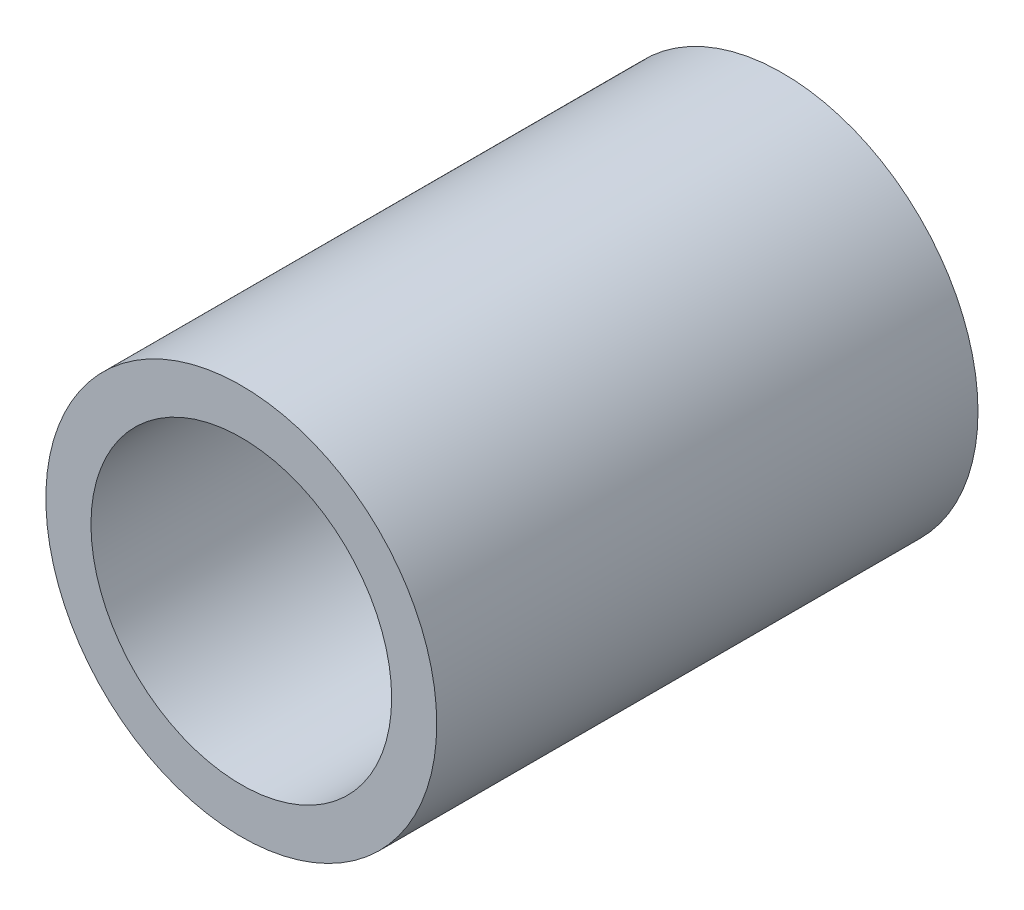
from build123d import *

# Parameters (mm, degrees)
ESQUISSE1_R      = 3.25
ESQUISSE1_R_2    = 2.5
EXTRUSION1_DEPTH = 9


with BuildPart() as part:
    # Esquisse1 → Extrusion1 (new body)
    with BuildSketch(Plane.XY):
        Circle(ESQUISSE1_R)
        Circle(ESQUISSE1_R_2, mode=Mode.SUBTRACT)
    extrude(amount=EXTRUSION1_DEPTH)


solid = part.part
